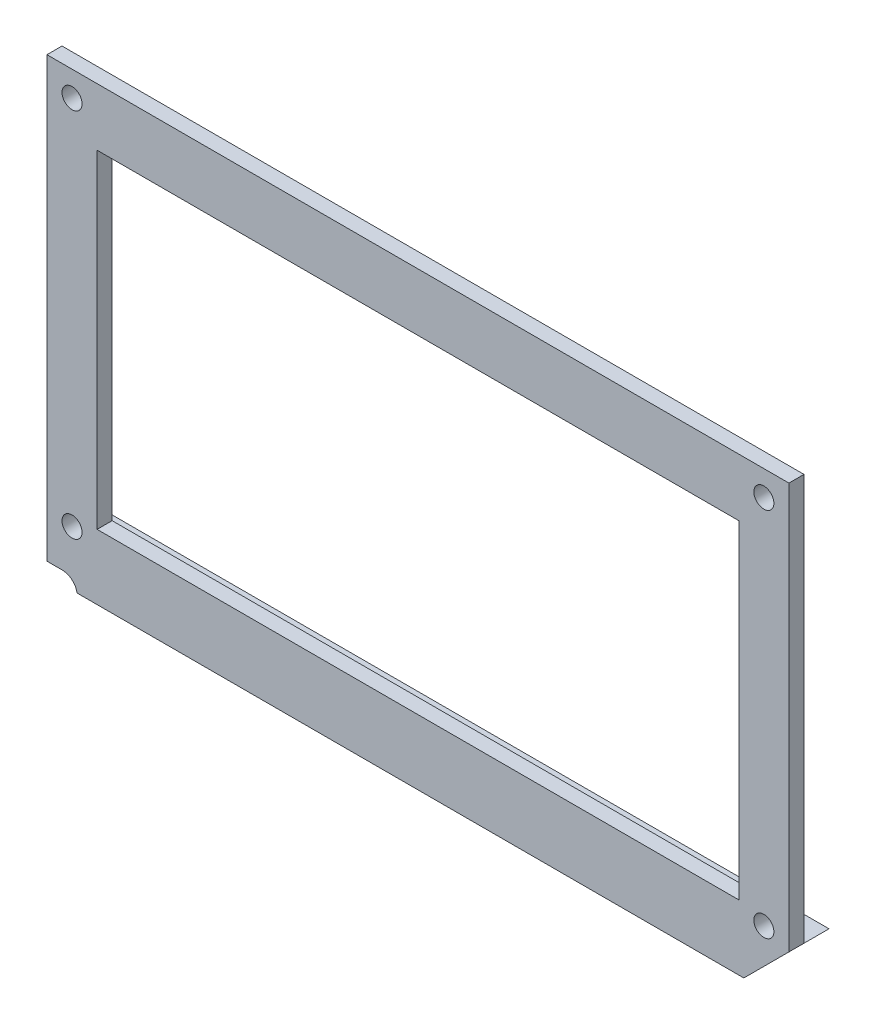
ISO-10303-21;
HEADER;
FILE_DESCRIPTION(('STEP AP214'),'2;1');
FILE_NAME('part.step','',(''),(''),'','','');
FILE_SCHEMA(('AUTOMOTIVE_DESIGN { 1 0 10303 214 1 1 1 1 }'));
ENDSEC;
DATA;
#1=APPLICATION_CONTEXT('core data for automotive mechanical design processes');
#2=APPLICATION_PROTOCOL_DEFINITION('international standard','automotive_design',2000,#1);
#3=PRODUCT_CONTEXT('',#1,'mechanical');
#4=PRODUCT('Part','Part','',(#3));
#5=PRODUCT_RELATED_PRODUCT_CATEGORY('part','',(#4));
#6=PRODUCT_DEFINITION_FORMATION('','',#4);
#7=PRODUCT_DEFINITION_CONTEXT('part definition',#1,'design');
#8=PRODUCT_DEFINITION('design','',#6,#7);
#9=PRODUCT_DEFINITION_SHAPE('','',#8);
#10=(LENGTH_UNIT() NAMED_UNIT(*) SI_UNIT(.MILLI.,.METRE.));
#11=(NAMED_UNIT(*) PLANE_ANGLE_UNIT() SI_UNIT($,.RADIAN.));
#12=(NAMED_UNIT(*) SI_UNIT($,.STERADIAN.) SOLID_ANGLE_UNIT());
#13=UNCERTAINTY_MEASURE_WITH_UNIT(LENGTH_MEASURE(1.E-05),#10,'distance_accuracy_value','');
#14=(GEOMETRIC_REPRESENTATION_CONTEXT(3) GLOBAL_UNCERTAINTY_ASSIGNED_CONTEXT((#13)) GLOBAL_UNIT_ASSIGNED_CONTEXT((#10,
#11,#12)) REPRESENTATION_CONTEXT('',''));
#15=CARTESIAN_POINT('',(0.,0.,0.));
#16=DIRECTION('',(0.,0.,1.));
#17=DIRECTION('',(1.,0.,0.));
#18=AXIS2_PLACEMENT_3D('',#15,#16,#17);
#19=CARTESIAN_POINT('',(40.,-31.5000000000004,-0.250000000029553));
#20=DIRECTION('',(-1.,0.,0.));
#21=DIRECTION('',(0.,1.,7.78409621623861E-13));
#22=AXIS2_PLACEMENT_3D('',#19,#20,#21);
#23=CYLINDRICAL_SURFACE('',#22,3.);
#24=CARTESIAN_POINT('',(-40.,-31.5000000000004,-0.250000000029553));
#25=DIRECTION('',(-0.707106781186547,-5.50418721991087E-13,0.707106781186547));
#26=DIRECTION('',(0.707106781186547,-5.50418721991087E-13,0.707106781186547));
#27=AXIS2_PLACEMENT_3D('',#24,#25,#26);
#28=ELLIPSE('',#27,4.24264068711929,3.);
#29=CARTESIAN_POINT('',(-40.,-34.5000000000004,-0.250000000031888));
#30=VERTEX_POINT('',#29);
#31=CARTESIAN_POINT('',(-37.,-31.5000000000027,2.74999999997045));
#32=VERTEX_POINT('',#31);
#33=EDGE_CURVE('E159',#30,#32,#28,.T.);
#34=ORIENTED_EDGE('',*,*,#33,.T.);
#35=DIRECTION('',(-1.,0.,0.));
#36=VECTOR('',#35,1.);
#37=CARTESIAN_POINT('',(40.,-31.5000000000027,2.74999999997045));
#38=LINE('',#37,#36);
#39=CARTESIAN_POINT('',(37.,-31.5000000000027,2.74999999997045));
#40=VERTEX_POINT('',#39);
#41=EDGE_CURVE('E171',#40,#32,#38,.T.);
#42=ORIENTED_EDGE('',*,*,#41,.F.);
#43=CARTESIAN_POINT('',(40.,-31.5000000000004,-0.250000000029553));
#44=DIRECTION('',(0.707106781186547,-5.50418721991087E-13,0.707106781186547));
#45=DIRECTION('',(-0.707106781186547,-5.50418721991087E-13,0.707106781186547));
#46=AXIS2_PLACEMENT_3D('',#43,#44,#45);
#47=ELLIPSE('',#46,4.24264068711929,3.);
#48=CARTESIAN_POINT('',(40.,-34.5000000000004,-0.250000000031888));
#49=VERTEX_POINT('',#48);
#50=EDGE_CURVE('E451',#40,#49,#47,.T.);
#51=ORIENTED_EDGE('',*,*,#50,.T.);
#52=DIRECTION('',(-1.,0.,0.));
#53=VECTOR('',#52,1.);
#54=CARTESIAN_POINT('',(40.,-34.5000000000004,-0.250000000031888));
#55=LINE('',#54,#53);
#56=EDGE_CURVE('E173',#49,#30,#55,.T.);
#57=ORIENTED_EDGE('',*,*,#56,.T.);
#58=EDGE_LOOP('',(#34,#42,#51,#57));
#59=FACE_BOUND('',#58,.T.);
#60=ADVANCED_FACE('F44',(#59),#23,.F.);
#61=CARTESIAN_POINT('',(0.,7.24999999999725,2.75000000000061));
#62=DIRECTION('',(0.,7.78409621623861E-13,-1.));
#63=DIRECTION('',(0.,1.,7.78409621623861E-13));
#64=AXIS2_PLACEMENT_3D('',#61,#62,#63);
#65=PLANE('',#64);
#66=DIRECTION('',(0.,-1.,-7.78409621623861E-13));
#67=VECTOR('',#66,1.);
#68=CARTESIAN_POINT('',(74.,-38.5000000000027,2.749999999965));
#69=LINE('',#68,#67);
#70=CARTESIAN_POINT('',(74.,51.4999999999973,2.75000000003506));
#71=VERTEX_POINT('',#70);
#72=CARTESIAN_POINT('',(74.,-29.5000000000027,2.749999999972));
#73=VERTEX_POINT('',#72);
#74=EDGE_CURVE('E314',#71,#73,#69,.T.);
#75=ORIENTED_EDGE('',*,*,#74,.T.);
#76=DIRECTION('',(0.707106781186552,0.707106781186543,5.50418721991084E-13));
#77=VECTOR('',#76,1.);
#78=CARTESIAN_POINT('',(55.3749999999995,-48.1250000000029,2.74999999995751));
#79=LINE('',#78,#77);
#80=CARTESIAN_POINT('',(68.9999999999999,-34.5000000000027,2.74999999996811));
#81=VERTEX_POINT('',#80);
#82=EDGE_CURVE('E354',#73,#81,#79,.F.);
#83=ORIENTED_EDGE('',*,*,#82,.T.);
#84=DIRECTION('',(1.,0.,0.));
#85=VECTOR('',#84,1.);
#86=CARTESIAN_POINT('',(-74.,-34.5000000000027,2.74999999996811));
#87=LINE('',#86,#85);
#88=CARTESIAN_POINT('',(40.,-34.5000000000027,2.74999999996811));
#89=VERTEX_POINT('',#88);
#90=EDGE_CURVE('E214',#89,#81,#87,.T.);
#91=ORIENTED_EDGE('',*,*,#90,.F.);
#92=CARTESIAN_POINT('',(40.,-31.5000000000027,2.74999999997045));
#93=DIRECTION('',(0.,7.78409621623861E-13,-1.));
#94=DIRECTION('',(0.,1.,7.78409621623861E-13));
#95=AXIS2_PLACEMENT_3D('',#92,#93,#94);
#96=CIRCLE('',#95,3.);
#97=EDGE_CURVE('E175',#89,#40,#96,.T.);
#98=ORIENTED_EDGE('',*,*,#97,.T.);
#99=ORIENTED_EDGE('',*,*,#41,.T.);
#100=CARTESIAN_POINT('',(-40.,-31.5000000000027,2.74999999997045));
#101=DIRECTION('',(0.,7.78409621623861E-13,-1.));
#102=DIRECTION('',(0.,1.,7.78409621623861E-13));
#103=AXIS2_PLACEMENT_3D('',#100,#101,#102);
#104=CIRCLE('',#103,3.);
#105=CARTESIAN_POINT('',(-40.,-34.5000000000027,2.74999999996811));
#106=VERTEX_POINT('',#105);
#107=EDGE_CURVE('E156',#32,#106,#104,.T.);
#108=ORIENTED_EDGE('',*,*,#107,.T.);
#109=CARTESIAN_POINT('',(-74.,-34.5000000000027,2.74999999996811));
#110=VERTEX_POINT('',#109);
#111=EDGE_CURVE('E225',#110,#106,#87,.T.);
#112=ORIENTED_EDGE('',*,*,#111,.F.);
#113=DIRECTION('',(0.,1.,7.78409621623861E-13));
#114=VECTOR('',#113,1.);
#115=CARTESIAN_POINT('',(-74.,-38.5000000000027,2.749999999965));
#116=LINE('',#115,#114);
#117=CARTESIAN_POINT('',(-74.,51.4999999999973,2.75000000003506));
#118=VERTEX_POINT('',#117);
#119=EDGE_CURVE('E317',#110,#118,#116,.T.);
#120=ORIENTED_EDGE('',*,*,#119,.T.);
#121=DIRECTION('',(1.,0.,0.));
#122=VECTOR('',#121,1.);
#123=CARTESIAN_POINT('',(-74.,51.4999999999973,2.75000000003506));
#124=LINE('',#123,#122);
#125=EDGE_CURVE('E321',#118,#71,#124,.T.);
#126=ORIENTED_EDGE('',*,*,#125,.T.);
#127=EDGE_LOOP('',(#75,#83,#91,#98,#99,#108,#112,#120,#126));
#128=FACE_BOUND('',#127,.T.);
#129=CARTESIAN_POINT('',(-69.,-27.5000000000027,2.74999999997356));
#130=DIRECTION('',(0.,7.78409621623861E-13,-1.));
#131=DIRECTION('',(0.,1.,7.78409621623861E-13));
#132=AXIS2_PLACEMENT_3D('',#129,#130,#131);
#133=CIRCLE('',#132,2.);
#134=CARTESIAN_POINT('',(-69.,-25.5000000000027,2.74999999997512));
#135=VERTEX_POINT('',#134);
#136=EDGE_CURVE('E247',#135,#135,#133,.T.);
#137=ORIENTED_EDGE('',*,*,#136,.F.);
#138=EDGE_LOOP('',(#137));
#139=FACE_BOUND('',#138,.T.);
#140=CARTESIAN_POINT('',(69.,-27.5000000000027,2.74999999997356));
#141=DIRECTION('',(0.,7.78409621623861E-13,-1.));
#142=DIRECTION('',(0.,1.,7.78409621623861E-13));
#143=AXIS2_PLACEMENT_3D('',#140,#141,#142);
#144=CIRCLE('',#143,2.);
#145=CARTESIAN_POINT('',(69.,-25.5000000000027,2.74999999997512));
#146=VERTEX_POINT('',#145);
#147=EDGE_CURVE('E263',#146,#146,#144,.T.);
#148=ORIENTED_EDGE('',*,*,#147,.F.);
#149=EDGE_LOOP('',(#148));
#150=FACE_BOUND('',#149,.T.);
#151=DIRECTION('',(-1.,0.,0.));
#152=VECTOR('',#151,1.);
#153=CARTESIAN_POINT('',(-64.,-25.5000000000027,2.74999999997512));
#154=LINE('',#153,#152);
#155=CARTESIAN_POINT('',(64.,-25.5000000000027,2.74999999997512));
#156=VERTEX_POINT('',#155);
#157=CARTESIAN_POINT('',(-64.,-25.5000000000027,2.74999999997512));
#158=VERTEX_POINT('',#157);
#159=EDGE_CURVE('E274',#156,#158,#154,.T.);
#160=ORIENTED_EDGE('',*,*,#159,.F.);
#161=DIRECTION('',(0.,-1.,-7.78409621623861E-13));
#162=VECTOR('',#161,1.);
#163=CARTESIAN_POINT('',(64.,-25.5000000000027,2.74999999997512));
#164=LINE('',#163,#162);
#165=CARTESIAN_POINT('',(64.,39.9999999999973,2.7500000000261));
#166=VERTEX_POINT('',#165);
#167=EDGE_CURVE('E271',#166,#156,#164,.T.);
#168=ORIENTED_EDGE('',*,*,#167,.F.);
#169=DIRECTION('',(1.,0.,0.));
#170=VECTOR('',#169,1.);
#171=CARTESIAN_POINT('',(-64.,39.9999999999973,2.7500000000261));
#172=LINE('',#171,#170);
#173=CARTESIAN_POINT('',(-64.,39.9999999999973,2.7500000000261));
#174=VERTEX_POINT('',#173);
#175=EDGE_CURVE('E282',#174,#166,#172,.T.);
#176=ORIENTED_EDGE('',*,*,#175,.F.);
#177=DIRECTION('',(0.,1.,7.78409621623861E-13));
#178=VECTOR('',#177,1.);
#179=CARTESIAN_POINT('',(-64.,-25.5000000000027,2.74999999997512));
#180=LINE('',#179,#178);
#181=EDGE_CURVE('E278',#158,#174,#180,.T.);
#182=ORIENTED_EDGE('',*,*,#181,.F.);
#183=EDGE_LOOP('',(#160,#168,#176,#182));
#184=FACE_BOUND('',#183,.T.);
#185=CARTESIAN_POINT('',(69.,46.4999999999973,2.75000000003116));
#186=DIRECTION('',(0.,7.78409621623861E-13,-1.));
#187=DIRECTION('',(0.,1.,7.78409621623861E-13));
#188=AXIS2_PLACEMENT_3D('',#185,#186,#187);
#189=CIRCLE('',#188,2.);
#190=CARTESIAN_POINT('',(69.,48.4999999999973,2.75000000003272));
#191=VERTEX_POINT('',#190);
#192=EDGE_CURVE('E255',#191,#191,#189,.T.);
#193=ORIENTED_EDGE('',*,*,#192,.F.);
#194=EDGE_LOOP('',(#193));
#195=FACE_BOUND('',#194,.T.);
#196=CARTESIAN_POINT('',(-69.,46.4999999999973,2.75000000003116));
#197=DIRECTION('',(0.,7.78409621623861E-13,-1.));
#198=DIRECTION('',(0.,1.,7.78409621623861E-13));
#199=AXIS2_PLACEMENT_3D('',#196,#197,#198);
#200=CIRCLE('',#199,2.);
#201=CARTESIAN_POINT('',(-69.,48.4999999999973,2.75000000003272));
#202=VERTEX_POINT('',#201);
#203=EDGE_CURVE('E239',#202,#202,#200,.T.);
#204=ORIENTED_EDGE('',*,*,#203,.F.);
#205=EDGE_LOOP('',(#204));
#206=FACE_BOUND('',#205,.T.);
#207=ADVANCED_FACE('F179',(#128,#139,#150,#184,#195,#206),#65,.T.);
#208=CARTESIAN_POINT('',(-74.,-34.4999999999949,-7.25000000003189));
#209=DIRECTION('',(0.,-1.,-7.78409621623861E-13));
#210=DIRECTION('',(-1.,0.,0.));
#211=AXIS2_PLACEMENT_3D('',#208,#209,#210);
#212=PLANE('',#211);
#213=CARTESIAN_POINT('',(57.,-34.4999999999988,-2.25000000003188));
#214=DIRECTION('',(0.,-1.,-7.78409621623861E-13));
#215=DIRECTION('',(-1.,0.,0.));
#216=AXIS2_PLACEMENT_3D('',#213,#214,#215);
#217=CIRCLE('',#216,2.15);
#218=CARTESIAN_POINT('',(54.85,-34.4999999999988,-2.25000000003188));
#219=VERTEX_POINT('',#218);
#220=EDGE_CURVE('E210',#219,#219,#217,.F.);
#221=ORIENTED_EDGE('',*,*,#220,.F.);
#222=EDGE_LOOP('',(#221));
#223=FACE_BOUND('',#222,.T.);
#224=CARTESIAN_POINT('',(-48.,-34.4999999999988,-2.25000000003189));
#225=DIRECTION('',(0.,-1.,-7.78409621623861E-13));
#226=DIRECTION('',(-1.,0.,0.));
#227=AXIS2_PLACEMENT_3D('',#224,#225,#226);
#228=CIRCLE('',#227,2.15);
#229=CARTESIAN_POINT('',(-50.15,-34.4999999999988,-2.25000000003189));
#230=VERTEX_POINT('',#229);
#231=EDGE_CURVE('E209',#230,#230,#228,.F.);
#232=ORIENTED_EDGE('',*,*,#231,.F.);
#233=EDGE_LOOP('',(#232));
#234=FACE_BOUND('',#233,.T.);
#235=ORIENTED_EDGE('',*,*,#90,.T.);
#236=DIRECTION('',(0.,-7.78409621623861E-13,1.));
#237=VECTOR('',#236,1.);
#238=CARTESIAN_POINT('',(68.9999999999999,-34.5000000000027,2.74999999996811));
#239=LINE('',#238,#237);
#240=CARTESIAN_POINT('',(68.9999999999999,-34.4999999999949,-7.25000000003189));
#241=VERTEX_POINT('',#240);
#242=EDGE_CURVE('E357',#81,#241,#239,.F.);
#243=ORIENTED_EDGE('',*,*,#242,.T.);
#244=DIRECTION('',(1.,0.,0.));
#245=VECTOR('',#244,1.);
#246=CARTESIAN_POINT('',(-74.,-34.4999999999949,-7.25000000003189));
#247=LINE('',#246,#245);
#248=CARTESIAN_POINT('',(-74.,-34.4999999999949,-7.25000000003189));
#249=VERTEX_POINT('',#248);
#250=EDGE_CURVE('E224',#249,#241,#247,.T.);
#251=ORIENTED_EDGE('',*,*,#250,.F.);
#252=DIRECTION('',(0.,-7.78409621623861E-13,1.));
#253=VECTOR('',#252,1.);
#254=CARTESIAN_POINT('',(-74.,-34.4999999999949,-7.25000000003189));
#255=LINE('',#254,#253);
#256=EDGE_CURVE('E232',#249,#110,#255,.T.);
#257=ORIENTED_EDGE('',*,*,#256,.T.);
#258=ORIENTED_EDGE('',*,*,#111,.T.);
#259=DIRECTION('',(0.,7.78409621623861E-13,-1.));
#260=VECTOR('',#259,1.);
#261=CARTESIAN_POINT('',(-40.,-34.5000000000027,2.74999999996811));
#262=LINE('',#261,#260);
#263=EDGE_CURVE('E162',#106,#30,#262,.T.);
#264=ORIENTED_EDGE('',*,*,#263,.T.);
#265=ORIENTED_EDGE('',*,*,#56,.F.);
#266=DIRECTION('',(0.,7.78409621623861E-13,-1.));
#267=VECTOR('',#266,1.);
#268=CARTESIAN_POINT('',(40.,-34.5000000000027,2.74999999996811));
#269=LINE('',#268,#267);
#270=EDGE_CURVE('E183',#89,#49,#269,.T.);
#271=ORIENTED_EDGE('',*,*,#270,.F.);
#272=EDGE_LOOP('',(#235,#243,#251,#257,#258,#264,#265,#271));
#273=FACE_BOUND('',#272,.T.);
#274=ADVANCED_FACE('F391',(#223,#234,#273),#212,.F.);
#275=CARTESIAN_POINT('',(-74.,-38.5000000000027,2.749999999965));
#276=DIRECTION('',(1.,0.,0.));
#277=DIRECTION('',(0.,-1.,-7.78409621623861E-13));
#278=AXIS2_PLACEMENT_3D('',#275,#276,#277);
#279=PLANE('',#278);
#280=DIRECTION('',(0.,7.78409621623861E-13,-1.));
#281=VECTOR('',#280,1.);
#282=CARTESIAN_POINT('',(-74.,-36.0000000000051,5.74999999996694));
#283=LINE('',#282,#281);
#284=CARTESIAN_POINT('',(-74.,-36.0000000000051,5.74999999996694));
#285=VERTEX_POINT('',#284);
#286=CARTESIAN_POINT('',(-74.,-35.999999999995,-7.25000000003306));
#287=VERTEX_POINT('',#286);
#288=EDGE_CURVE('E193',#285,#287,#283,.T.);
#289=ORIENTED_EDGE('',*,*,#288,.F.);
#290=DIRECTION('',(0.,1.,7.78409621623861E-13));
#291=VECTOR('',#290,1.);
#292=CARTESIAN_POINT('',(-74.,-38.5000000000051,5.749999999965));
#293=LINE('',#292,#291);
#294=CARTESIAN_POINT('',(-74.,51.4999999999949,5.75000000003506));
#295=VERTEX_POINT('',#294);
#296=EDGE_CURVE('E332',#285,#295,#293,.T.);
#297=ORIENTED_EDGE('',*,*,#296,.T.);
#298=DIRECTION('',(0.,-7.78409621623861E-13,1.));
#299=VECTOR('',#298,1.);
#300=CARTESIAN_POINT('',(-74.,51.4999999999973,2.75000000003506));
#301=LINE('',#300,#299);
#302=EDGE_CURVE('E340',#118,#295,#301,.T.);
#303=ORIENTED_EDGE('',*,*,#302,.F.);
#304=ORIENTED_EDGE('',*,*,#119,.F.);
#305=ORIENTED_EDGE('',*,*,#256,.F.);
#306=DIRECTION('',(0.,1.,7.78409621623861E-13));
#307=VECTOR('',#306,1.);
#308=CARTESIAN_POINT('',(-74.,-38.499999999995,-7.250000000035));
#309=LINE('',#308,#307);
#310=EDGE_CURVE('E221',#287,#249,#309,.T.);
#311=ORIENTED_EDGE('',*,*,#310,.F.);
#312=EDGE_LOOP('',(#289,#297,#303,#304,#305,#311));
#313=FACE_BOUND('',#312,.T.);
#314=ADVANCED_FACE('F386',(#313),#279,.F.);
#315=CARTESIAN_POINT('',(0.,7.24999999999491,5.75000000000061));
#316=DIRECTION('',(0.,7.78409621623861E-13,-1.));
#317=DIRECTION('',(0.,1.,7.78409621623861E-13));
#318=AXIS2_PLACEMENT_3D('',#315,#316,#317);
#319=PLANE('',#318);
#320=DIRECTION('',(-1.,0.,0.));
#321=VECTOR('',#320,1.);
#322=CARTESIAN_POINT('',(-74.,-38.5000000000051,5.749999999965));
#323=LINE('',#322,#321);
#324=CARTESIAN_POINT('',(64.9999999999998,-38.5000000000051,5.749999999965));
#325=VERTEX_POINT('',#324);
#326=CARTESIAN_POINT('',(-68.,-38.5000000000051,5.749999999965));
#327=VERTEX_POINT('',#326);
#328=EDGE_CURVE('E328',#325,#327,#323,.T.);
#329=ORIENTED_EDGE('',*,*,#328,.F.);
#330=DIRECTION('',(-0.707106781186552,-0.707106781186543,-5.50418721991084E-13));
#331=VECTOR('',#330,1.);
#332=CARTESIAN_POINT('',(64.9999999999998,-38.5000000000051,5.749999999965));
#333=LINE('',#332,#331);
#334=CARTESIAN_POINT('',(74.,-29.500000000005,5.749999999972));
#335=VERTEX_POINT('',#334);
#336=EDGE_CURVE('E348',#325,#335,#333,.F.);
#337=ORIENTED_EDGE('',*,*,#336,.T.);
#338=DIRECTION('',(0.,-1.,-7.78409621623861E-13));
#339=VECTOR('',#338,1.);
#340=CARTESIAN_POINT('',(74.,-38.5000000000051,5.749999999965));
#341=LINE('',#340,#339);
#342=CARTESIAN_POINT('',(74.,51.4999999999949,5.75000000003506));
#343=VERTEX_POINT('',#342);
#344=EDGE_CURVE('E313',#343,#335,#341,.T.);
#345=ORIENTED_EDGE('',*,*,#344,.F.);
#346=DIRECTION('',(1.,0.,0.));
#347=VECTOR('',#346,1.);
#348=CARTESIAN_POINT('',(-74.,51.4999999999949,5.75000000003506));
#349=LINE('',#348,#347);
#350=EDGE_CURVE('E318',#295,#343,#349,.T.);
#351=ORIENTED_EDGE('',*,*,#350,.F.);
#352=ORIENTED_EDGE('',*,*,#296,.F.);
#353=DIRECTION('',(-1.,0.,0.));
#354=VECTOR('',#353,1.);
#355=CARTESIAN_POINT('',(-74.,-36.0000000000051,5.74999999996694));
#356=LINE('',#355,#354);
#357=CARTESIAN_POINT('',(-70.9580398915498,-36.0000000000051,5.74999999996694));
#358=VERTEX_POINT('',#357);
#359=EDGE_CURVE('E199',#358,#285,#356,.T.);
#360=ORIENTED_EDGE('',*,*,#359,.F.);
#361=CARTESIAN_POINT('',(-70.9580398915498,-39.0000000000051,5.74999999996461));
#362=DIRECTION('',(0.,7.78409621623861E-13,-1.));
#363=DIRECTION('',(0.,1.,7.78409621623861E-13));
#364=AXIS2_PLACEMENT_3D('',#361,#362,#363);
#365=CIRCLE('',#364,3.);
#366=EDGE_CURVE('E53',#358,#327,#365,.T.);
#367=ORIENTED_EDGE('',*,*,#366,.T.);
#368=EDGE_LOOP('',(#329,#337,#345,#351,#352,#360,#367));
#369=FACE_BOUND('',#368,.T.);
#370=DIRECTION('',(0.,-1.,-7.78409621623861E-13));
#371=VECTOR('',#370,1.);
#372=CARTESIAN_POINT('',(64.,-25.5000000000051,5.74999999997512));
#373=LINE('',#372,#371);
#374=CARTESIAN_POINT('',(64.,39.9999999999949,5.7500000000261));
#375=VERTEX_POINT('',#374);
#376=CARTESIAN_POINT('',(64.,-25.5000000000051,5.74999999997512));
#377=VERTEX_POINT('',#376);
#378=EDGE_CURVE('E267',#375,#377,#373,.T.);
#379=ORIENTED_EDGE('',*,*,#378,.T.);
#380=DIRECTION('',(-1.,0.,0.));
#381=VECTOR('',#380,1.);
#382=CARTESIAN_POINT('',(-64.,-25.5000000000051,5.74999999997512));
#383=LINE('',#382,#381);
#384=CARTESIAN_POINT('',(-64.,-25.5000000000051,5.74999999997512));
#385=VERTEX_POINT('',#384);
#386=EDGE_CURVE('E289',#377,#385,#383,.T.);
#387=ORIENTED_EDGE('',*,*,#386,.T.);
#388=DIRECTION('',(0.,1.,7.78409621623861E-13));
#389=VECTOR('',#388,1.);
#390=CARTESIAN_POINT('',(-64.,-25.5000000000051,5.74999999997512));
#391=LINE('',#390,#389);
#392=CARTESIAN_POINT('',(-64.,39.9999999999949,5.7500000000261));
#393=VERTEX_POINT('',#392);
#394=EDGE_CURVE('E293',#385,#393,#391,.T.);
#395=ORIENTED_EDGE('',*,*,#394,.T.);
#396=DIRECTION('',(1.,0.,0.));
#397=VECTOR('',#396,1.);
#398=CARTESIAN_POINT('',(-64.,39.9999999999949,5.7500000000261));
#399=LINE('',#398,#397);
#400=EDGE_CURVE('E275',#393,#375,#399,.T.);
#401=ORIENTED_EDGE('',*,*,#400,.T.);
#402=EDGE_LOOP('',(#379,#387,#395,#401));
#403=FACE_BOUND('',#402,.T.);
#404=CARTESIAN_POINT('',(69.,-27.5000000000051,5.74999999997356));
#405=DIRECTION('',(0.,7.78409621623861E-13,-1.));
#406=DIRECTION('',(0.,1.,7.78409621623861E-13));
#407=AXIS2_PLACEMENT_3D('',#404,#405,#406);
#408=CIRCLE('',#407,2.);
#409=CARTESIAN_POINT('',(69.,-25.5000000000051,5.74999999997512));
#410=VERTEX_POINT('',#409);
#411=EDGE_CURVE('E259',#410,#410,#408,.T.);
#412=ORIENTED_EDGE('',*,*,#411,.T.);
#413=EDGE_LOOP('',(#412));
#414=FACE_BOUND('',#413,.T.);
#415=CARTESIAN_POINT('',(69.,46.4999999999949,5.75000000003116));
#416=DIRECTION('',(0.,7.78409621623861E-13,-1.));
#417=DIRECTION('',(0.,1.,7.78409621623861E-13));
#418=AXIS2_PLACEMENT_3D('',#415,#416,#417);
#419=CIRCLE('',#418,2.);
#420=CARTESIAN_POINT('',(69.,48.4999999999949,5.75000000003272));
#421=VERTEX_POINT('',#420);
#422=EDGE_CURVE('E251',#421,#421,#419,.T.);
#423=ORIENTED_EDGE('',*,*,#422,.T.);
#424=EDGE_LOOP('',(#423));
#425=FACE_BOUND('',#424,.T.);
#426=CARTESIAN_POINT('',(-69.,-27.5000000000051,5.74999999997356));
#427=DIRECTION('',(0.,7.78409621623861E-13,-1.));
#428=DIRECTION('',(0.,1.,7.78409621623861E-13));
#429=AXIS2_PLACEMENT_3D('',#426,#427,#428);
#430=CIRCLE('',#429,2.);
#431=CARTESIAN_POINT('',(-69.,-25.5000000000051,5.74999999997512));
#432=VERTEX_POINT('',#431);
#433=EDGE_CURVE('E243',#432,#432,#430,.T.);
#434=ORIENTED_EDGE('',*,*,#433,.T.);
#435=EDGE_LOOP('',(#434));
#436=FACE_BOUND('',#435,.T.);
#437=CARTESIAN_POINT('',(-69.,46.4999999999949,5.75000000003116));
#438=DIRECTION('',(0.,7.78409621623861E-13,-1.));
#439=DIRECTION('',(0.,1.,7.78409621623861E-13));
#440=AXIS2_PLACEMENT_3D('',#437,#438,#439);
#441=CIRCLE('',#440,2.);
#442=CARTESIAN_POINT('',(-69.,48.4999999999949,5.75000000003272));
#443=VERTEX_POINT('',#442);
#444=EDGE_CURVE('E238',#443,#443,#441,.T.);
#445=ORIENTED_EDGE('',*,*,#444,.T.);
#446=EDGE_LOOP('',(#445));
#447=FACE_BOUND('',#446,.T.);
#448=ADVANCED_FACE('F370',(#369,#403,#414,#425,#436,#447),#319,.F.);
#449=CARTESIAN_POINT('',(74.,-38.5000000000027,2.749999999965));
#450=DIRECTION('',(-1.,0.,0.));
#451=DIRECTION('',(0.,1.,7.78409621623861E-13));
#452=AXIS2_PLACEMENT_3D('',#449,#450,#451);
#453=PLANE('',#452);
#454=ORIENTED_EDGE('',*,*,#344,.T.);
#455=DIRECTION('',(0.,7.78409621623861E-13,-1.));
#456=VECTOR('',#455,1.);
#457=CARTESIAN_POINT('',(74.,-29.5000000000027,2.749999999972));
#458=LINE('',#457,#456);
#459=EDGE_CURVE('E351',#335,#73,#458,.T.);
#460=ORIENTED_EDGE('',*,*,#459,.T.);
#461=ORIENTED_EDGE('',*,*,#74,.F.);
#462=DIRECTION('',(0.,-7.78409621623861E-13,1.));
#463=VECTOR('',#462,1.);
#464=CARTESIAN_POINT('',(74.,51.4999999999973,2.75000000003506));
#465=LINE('',#464,#463);
#466=EDGE_CURVE('E324',#71,#343,#465,.T.);
#467=ORIENTED_EDGE('',*,*,#466,.T.);
#468=EDGE_LOOP('',(#454,#460,#461,#467));
#469=FACE_BOUND('',#468,.T.);
#470=ADVANCED_FACE('F401',(#469),#453,.F.);
#471=CARTESIAN_POINT('',(-74.,-38.5000000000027,2.749999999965));
#472=DIRECTION('',(0.,1.,7.78409621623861E-13));
#473=DIRECTION('',(1.,0.,0.));
#474=AXIS2_PLACEMENT_3D('',#471,#472,#473);
#475=PLANE('',#474);
#476=CARTESIAN_POINT('',(-48.,-38.4999999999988,-2.250000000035));
#477=DIRECTION('',(0.,-1.,-7.78409621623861E-13));
#478=DIRECTION('',(-1.,0.,0.));
#479=AXIS2_PLACEMENT_3D('',#476,#477,#478);
#480=CIRCLE('',#479,2.15);
#481=CARTESIAN_POINT('',(-50.15,-38.4999999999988,-2.250000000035));
#482=VERTEX_POINT('',#481);
#483=EDGE_CURVE('E205',#482,#482,#480,.T.);
#484=ORIENTED_EDGE('',*,*,#483,.F.);
#485=EDGE_LOOP('',(#484));
#486=FACE_BOUND('',#485,.T.);
#487=CARTESIAN_POINT('',(57.,-38.4999999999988,-2.25000000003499));
#488=DIRECTION('',(0.,-1.,-7.78409621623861E-13));
#489=DIRECTION('',(-1.,0.,0.));
#490=AXIS2_PLACEMENT_3D('',#487,#488,#489);
#491=CIRCLE('',#490,2.15);
#492=CARTESIAN_POINT('',(54.85,-38.4999999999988,-2.25000000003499));
#493=VERTEX_POINT('',#492);
#494=EDGE_CURVE('E202',#493,#493,#491,.T.);
#495=ORIENTED_EDGE('',*,*,#494,.F.);
#496=EDGE_LOOP('',(#495));
#497=FACE_BOUND('',#496,.T.);
#498=DIRECTION('',(-1.,0.,0.));
#499=VECTOR('',#498,1.);
#500=CARTESIAN_POINT('',(-74.,-38.499999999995,-7.250000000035));
#501=LINE('',#500,#499);
#502=CARTESIAN_POINT('',(64.9999999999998,-38.499999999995,-7.250000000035));
#503=VERTEX_POINT('',#502);
#504=CARTESIAN_POINT('',(-68.,-38.499999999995,-7.250000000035));
#505=VERTEX_POINT('',#504);
#506=EDGE_CURVE('E229',#503,#505,#501,.T.);
#507=ORIENTED_EDGE('',*,*,#506,.F.);
#508=DIRECTION('',(0.,-7.78409621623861E-13,1.));
#509=VECTOR('',#508,1.);
#510=CARTESIAN_POINT('',(64.9999999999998,-38.5000000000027,2.749999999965));
#511=LINE('',#510,#509);
#512=EDGE_CURVE('E344',#503,#325,#511,.T.);
#513=ORIENTED_EDGE('',*,*,#512,.T.);
#514=ORIENTED_EDGE('',*,*,#328,.T.);
#515=DIRECTION('',(0.,-7.78409621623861E-13,1.));
#516=VECTOR('',#515,1.);
#517=CARTESIAN_POINT('',(-68.,-38.5000000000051,5.749999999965));
#518=LINE('',#517,#516);
#519=EDGE_CURVE('E188',#505,#327,#518,.T.);
#520=ORIENTED_EDGE('',*,*,#519,.F.);
#521=EDGE_LOOP('',(#507,#513,#514,#520));
#522=FACE_BOUND('',#521,.T.);
#523=ADVANCED_FACE('F376',(#486,#497,#522),#475,.F.);
#524=CARTESIAN_POINT('',(-74.,51.4999999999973,2.75000000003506));
#525=DIRECTION('',(0.,-1.,-7.78409621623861E-13));
#526=DIRECTION('',(-1.,0.,0.));
#527=AXIS2_PLACEMENT_3D('',#524,#525,#526);
#528=PLANE('',#527);
#529=ORIENTED_EDGE('',*,*,#350,.T.);
#530=ORIENTED_EDGE('',*,*,#466,.F.);
#531=ORIENTED_EDGE('',*,*,#125,.F.);
#532=ORIENTED_EDGE('',*,*,#302,.T.);
#533=EDGE_LOOP('',(#529,#530,#531,#532));
#534=FACE_BOUND('',#533,.T.);
#535=ADVANCED_FACE('F406',(#534),#528,.F.);
#536=CARTESIAN_POINT('',(64.,-25.5000000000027,2.74999999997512));
#537=DIRECTION('',(-1.,0.,0.));
#538=DIRECTION('',(0.,1.,7.78409621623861E-13));
#539=AXIS2_PLACEMENT_3D('',#536,#537,#538);
#540=PLANE('',#539);
#541=ORIENTED_EDGE('',*,*,#378,.F.);
#542=DIRECTION('',(0.,-7.78409621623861E-13,1.));
#543=VECTOR('',#542,1.);
#544=CARTESIAN_POINT('',(64.,39.9999999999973,2.7500000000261));
#545=LINE('',#544,#543);
#546=EDGE_CURVE('E285',#166,#375,#545,.T.);
#547=ORIENTED_EDGE('',*,*,#546,.F.);
#548=ORIENTED_EDGE('',*,*,#167,.T.);
#549=DIRECTION('',(0.,-7.78409621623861E-13,1.));
#550=VECTOR('',#549,1.);
#551=CARTESIAN_POINT('',(64.,-25.5000000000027,2.74999999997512));
#552=LINE('',#551,#550);
#553=EDGE_CURVE('E309',#156,#377,#552,.T.);
#554=ORIENTED_EDGE('',*,*,#553,.T.);
#555=EDGE_LOOP('',(#541,#547,#548,#554));
#556=FACE_BOUND('',#555,.T.);
#557=ADVANCED_FACE('F531',(#556),#540,.T.);
#558=CARTESIAN_POINT('',(-64.,-25.5000000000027,2.74999999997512));
#559=DIRECTION('',(0.,1.,7.78409621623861E-13));
#560=DIRECTION('',(1.,0.,0.));
#561=AXIS2_PLACEMENT_3D('',#558,#559,#560);
#562=PLANE('',#561);
#563=ORIENTED_EDGE('',*,*,#386,.F.);
#564=ORIENTED_EDGE('',*,*,#553,.F.);
#565=ORIENTED_EDGE('',*,*,#159,.T.);
#566=DIRECTION('',(0.,-7.78409621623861E-13,1.));
#567=VECTOR('',#566,1.);
#568=CARTESIAN_POINT('',(-64.,-25.5000000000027,2.74999999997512));
#569=LINE('',#568,#567);
#570=EDGE_CURVE('E306',#158,#385,#569,.T.);
#571=ORIENTED_EDGE('',*,*,#570,.T.);
#572=EDGE_LOOP('',(#563,#564,#565,#571));
#573=FACE_BOUND('',#572,.T.);
#574=ADVANCED_FACE('F527',(#573),#562,.T.);
#575=CARTESIAN_POINT('',(-64.,-25.5000000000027,2.74999999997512));
#576=DIRECTION('',(1.,0.,0.));
#577=DIRECTION('',(0.,-1.,-7.78409621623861E-13));
#578=AXIS2_PLACEMENT_3D('',#575,#576,#577);
#579=PLANE('',#578);
#580=ORIENTED_EDGE('',*,*,#394,.F.);
#581=ORIENTED_EDGE('',*,*,#570,.F.);
#582=ORIENTED_EDGE('',*,*,#181,.T.);
#583=DIRECTION('',(0.,-7.78409621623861E-13,1.));
#584=VECTOR('',#583,1.);
#585=CARTESIAN_POINT('',(-64.,39.9999999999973,2.7500000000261));
#586=LINE('',#585,#584);
#587=EDGE_CURVE('E303',#174,#393,#586,.T.);
#588=ORIENTED_EDGE('',*,*,#587,.T.);
#589=EDGE_LOOP('',(#580,#581,#582,#588));
#590=FACE_BOUND('',#589,.T.);
#591=ADVANCED_FACE('F523',(#590),#579,.T.);
#592=CARTESIAN_POINT('',(-64.,39.9999999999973,2.7500000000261));
#593=DIRECTION('',(0.,-1.,-7.78409621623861E-13));
#594=DIRECTION('',(-1.,0.,0.));
#595=AXIS2_PLACEMENT_3D('',#592,#593,#594);
#596=PLANE('',#595);
#597=ORIENTED_EDGE('',*,*,#400,.F.);
#598=ORIENTED_EDGE('',*,*,#587,.F.);
#599=ORIENTED_EDGE('',*,*,#175,.T.);
#600=ORIENTED_EDGE('',*,*,#546,.T.);
#601=EDGE_LOOP('',(#597,#598,#599,#600));
#602=FACE_BOUND('',#601,.T.);
#603=ADVANCED_FACE('F519',(#602),#596,.T.);
#604=CARTESIAN_POINT('',(69.,-27.5000000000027,2.74999999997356));
#605=DIRECTION('',(0.,-7.78409621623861E-13,1.));
#606=DIRECTION('',(0.,-1.,-7.78409621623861E-13));
#607=AXIS2_PLACEMENT_3D('',#604,#605,#606);
#608=CYLINDRICAL_SURFACE('',#607,2.);
#609=ORIENTED_EDGE('',*,*,#147,.T.);
#610=EDGE_LOOP('',(#609));
#611=FACE_BOUND('',#610,.T.);
#612=ORIENTED_EDGE('',*,*,#411,.F.);
#613=EDGE_LOOP('',(#612));
#614=FACE_BOUND('',#613,.T.);
#615=ADVANCED_FACE('F515',(#611,#614),#608,.F.);
#616=CARTESIAN_POINT('',(69.,46.4999999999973,2.75000000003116));
#617=DIRECTION('',(0.,-7.78409621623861E-13,1.));
#618=DIRECTION('',(0.,-1.,-7.78409621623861E-13));
#619=AXIS2_PLACEMENT_3D('',#616,#617,#618);
#620=CYLINDRICAL_SURFACE('',#619,2.);
#621=ORIENTED_EDGE('',*,*,#192,.T.);
#622=EDGE_LOOP('',(#621));
#623=FACE_BOUND('',#622,.T.);
#624=ORIENTED_EDGE('',*,*,#422,.F.);
#625=EDGE_LOOP('',(#624));
#626=FACE_BOUND('',#625,.T.);
#627=ADVANCED_FACE('F511',(#623,#626),#620,.F.);
#628=CARTESIAN_POINT('',(-69.,-27.5000000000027,2.74999999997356));
#629=DIRECTION('',(0.,-7.78409621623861E-13,1.));
#630=DIRECTION('',(0.,-1.,-7.78409621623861E-13));
#631=AXIS2_PLACEMENT_3D('',#628,#629,#630);
#632=CYLINDRICAL_SURFACE('',#631,2.);
#633=ORIENTED_EDGE('',*,*,#136,.T.);
#634=EDGE_LOOP('',(#633));
#635=FACE_BOUND('',#634,.T.);
#636=ORIENTED_EDGE('',*,*,#433,.F.);
#637=EDGE_LOOP('',(#636));
#638=FACE_BOUND('',#637,.T.);
#639=ADVANCED_FACE('F507',(#635,#638),#632,.F.);
#640=CARTESIAN_POINT('',(-69.,46.4999999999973,2.75000000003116));
#641=DIRECTION('',(0.,-7.78409621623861E-13,1.));
#642=DIRECTION('',(0.,-1.,-7.78409621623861E-13));
#643=AXIS2_PLACEMENT_3D('',#640,#641,#642);
#644=CYLINDRICAL_SURFACE('',#643,2.);
#645=ORIENTED_EDGE('',*,*,#203,.T.);
#646=EDGE_LOOP('',(#645));
#647=FACE_BOUND('',#646,.T.);
#648=ORIENTED_EDGE('',*,*,#444,.F.);
#649=EDGE_LOOP('',(#648));
#650=FACE_BOUND('',#649,.T.);
#651=ADVANCED_FACE('F501',(#647,#650),#644,.F.);
#652=CARTESIAN_POINT('',(0.,7.25000000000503,-7.24999999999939));
#653=DIRECTION('',(0.,7.78409621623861E-13,-1.));
#654=DIRECTION('',(0.,1.,7.78409621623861E-13));
#655=AXIS2_PLACEMENT_3D('',#652,#653,#654);
#656=PLANE('',#655);
#657=ORIENTED_EDGE('',*,*,#250,.T.);
#658=DIRECTION('',(0.707106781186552,0.707106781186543,5.50418721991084E-13));
#659=VECTOR('',#658,1.);
#660=CARTESIAN_POINT('',(55.3749999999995,-48.1249999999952,-7.25000000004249));
#661=LINE('',#660,#659);
#662=EDGE_CURVE('E360',#241,#503,#661,.F.);
#663=ORIENTED_EDGE('',*,*,#662,.T.);
#664=ORIENTED_EDGE('',*,*,#506,.T.);
#665=CARTESIAN_POINT('',(-70.9580398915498,-38.999999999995,-7.25000000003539));
#666=DIRECTION('',(0.,7.78409621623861E-13,-1.));
#667=DIRECTION('',(0.,1.,7.78409621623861E-13));
#668=AXIS2_PLACEMENT_3D('',#665,#666,#667);
#669=CIRCLE('',#668,3.);
#670=CARTESIAN_POINT('',(-70.9580398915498,-35.999999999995,-7.25000000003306));
#671=VERTEX_POINT('',#670);
#672=EDGE_CURVE('E11',#505,#671,#669,.F.);
#673=ORIENTED_EDGE('',*,*,#672,.T.);
#674=DIRECTION('',(1.,0.,0.));
#675=VECTOR('',#674,1.);
#676=CARTESIAN_POINT('',(-74.,-35.999999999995,-7.25000000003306));
#677=LINE('',#676,#675);
#678=EDGE_CURVE('E196',#287,#671,#677,.T.);
#679=ORIENTED_EDGE('',*,*,#678,.F.);
#680=ORIENTED_EDGE('',*,*,#310,.T.);
#681=EDGE_LOOP('',(#657,#663,#664,#673,#679,#680));
#682=FACE_BOUND('',#681,.T.);
#683=ADVANCED_FACE('F382',(#682),#656,.T.);
#684=CARTESIAN_POINT('',(57.,51.5010000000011,-2.24999999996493));
#685=DIRECTION('',(0.,-1.,-7.78409621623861E-13));
#686=DIRECTION('',(-1.,0.,0.));
#687=AXIS2_PLACEMENT_3D('',#684,#685,#686);
#688=CYLINDRICAL_SURFACE('',#687,2.15);
#689=CARTESIAN_POINT('',(54.85,-38.4999999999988,-2.25000000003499));
#690=CARTESIAN_POINT('',(54.85,-38.4583333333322,-2.25000000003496));
#691=CARTESIAN_POINT('',(54.85,-38.4166666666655,-2.25000000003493));
#692=CARTESIAN_POINT('',(54.85,-38.3333333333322,-2.25000000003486));
#693=CARTESIAN_POINT('',(54.85,-38.2916666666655,-2.25000000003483));
#694=CARTESIAN_POINT('',(54.85,-38.2083333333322,-2.25000000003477));
#695=CARTESIAN_POINT('',(54.85,-38.1666666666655,-2.25000000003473));
#696=CARTESIAN_POINT('',(54.85,-38.0833333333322,-2.25000000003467));
#697=CARTESIAN_POINT('',(54.85,-38.0416666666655,-2.25000000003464));
#698=CARTESIAN_POINT('',(54.85,-37.9583333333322,-2.25000000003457));
#699=CARTESIAN_POINT('',(54.85,-37.9166666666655,-2.25000000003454));
#700=CARTESIAN_POINT('',(54.85,-37.8333333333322,-2.25000000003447));
#701=CARTESIAN_POINT('',(54.85,-37.7916666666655,-2.25000000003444));
#702=CARTESIAN_POINT('',(54.85,-37.7083333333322,-2.25000000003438));
#703=CARTESIAN_POINT('',(54.85,-37.6666666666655,-2.25000000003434));
#704=CARTESIAN_POINT('',(54.85,-37.5833333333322,-2.25000000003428));
#705=CARTESIAN_POINT('',(54.85,-37.5416666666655,-2.25000000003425));
#706=CARTESIAN_POINT('',(54.85,-37.4583333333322,-2.25000000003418));
#707=CARTESIAN_POINT('',(54.85,-37.4166666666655,-2.25000000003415));
#708=CARTESIAN_POINT('',(54.85,-37.3333333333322,-2.25000000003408));
#709=CARTESIAN_POINT('',(54.85,-37.2916666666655,-2.25000000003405));
#710=CARTESIAN_POINT('',(54.85,-37.2083333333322,-2.25000000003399));
#711=CARTESIAN_POINT('',(54.85,-37.1666666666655,-2.25000000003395));
#712=CARTESIAN_POINT('',(54.85,-37.0833333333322,-2.25000000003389));
#713=CARTESIAN_POINT('',(54.85,-37.0416666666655,-2.25000000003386));
#714=CARTESIAN_POINT('',(54.85,-36.9583333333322,-2.25000000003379));
#715=CARTESIAN_POINT('',(54.85,-36.9166666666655,-2.25000000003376));
#716=CARTESIAN_POINT('',(54.85,-36.8333333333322,-2.25000000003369));
#717=CARTESIAN_POINT('',(54.85,-36.7916666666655,-2.25000000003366));
#718=CARTESIAN_POINT('',(54.85,-36.7083333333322,-2.2500000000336));
#719=CARTESIAN_POINT('',(54.85,-36.6666666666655,-2.25000000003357));
#720=CARTESIAN_POINT('',(54.85,-36.5833333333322,-2.2500000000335));
#721=CARTESIAN_POINT('',(54.85,-36.5416666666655,-2.25000000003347));
#722=CARTESIAN_POINT('',(54.85,-36.4583333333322,-2.2500000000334));
#723=CARTESIAN_POINT('',(54.85,-36.4166666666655,-2.25000000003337));
#724=CARTESIAN_POINT('',(54.85,-36.3333333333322,-2.25000000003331));
#725=CARTESIAN_POINT('',(54.85,-36.2916666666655,-2.25000000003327));
#726=CARTESIAN_POINT('',(54.85,-36.2083333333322,-2.25000000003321));
#727=CARTESIAN_POINT('',(54.85,-36.1666666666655,-2.25000000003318));
#728=CARTESIAN_POINT('',(54.85,-36.0833333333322,-2.25000000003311));
#729=CARTESIAN_POINT('',(54.85,-36.0416666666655,-2.25000000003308));
#730=CARTESIAN_POINT('',(54.85,-35.9583333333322,-2.25000000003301));
#731=CARTESIAN_POINT('',(54.85,-35.9166666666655,-2.25000000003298));
#732=CARTESIAN_POINT('',(54.85,-35.8333333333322,-2.25000000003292));
#733=CARTESIAN_POINT('',(54.85,-35.7916666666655,-2.25000000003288));
#734=CARTESIAN_POINT('',(54.85,-35.7083333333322,-2.25000000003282));
#735=CARTESIAN_POINT('',(54.85,-35.6666666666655,-2.25000000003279));
#736=CARTESIAN_POINT('',(54.85,-35.5833333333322,-2.25000000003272));
#737=CARTESIAN_POINT('',(54.85,-35.5416666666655,-2.25000000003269));
#738=CARTESIAN_POINT('',(54.85,-35.4583333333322,-2.25000000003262));
#739=CARTESIAN_POINT('',(54.85,-35.4166666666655,-2.25000000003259));
#740=CARTESIAN_POINT('',(54.85,-35.3333333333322,-2.25000000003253));
#741=CARTESIAN_POINT('',(54.85,-35.2916666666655,-2.25000000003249));
#742=CARTESIAN_POINT('',(54.85,-35.2083333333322,-2.25000000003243));
#743=CARTESIAN_POINT('',(54.85,-35.1666666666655,-2.2500000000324));
#744=CARTESIAN_POINT('',(54.85,-35.0833333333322,-2.25000000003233));
#745=CARTESIAN_POINT('',(54.85,-35.0416666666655,-2.2500000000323));
#746=CARTESIAN_POINT('',(54.85,-34.9583333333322,-2.25000000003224));
#747=CARTESIAN_POINT('',(54.85,-34.9166666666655,-2.2500000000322));
#748=CARTESIAN_POINT('',(54.85,-34.8333333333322,-2.25000000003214));
#749=CARTESIAN_POINT('',(54.85,-34.7916666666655,-2.25000000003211));
#750=CARTESIAN_POINT('',(54.85,-34.7083333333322,-2.25000000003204));
#751=CARTESIAN_POINT('',(54.85,-34.6666666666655,-2.25000000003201));
#752=CARTESIAN_POINT('',(54.85,-34.5833333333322,-2.25000000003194));
#753=CARTESIAN_POINT('',(54.85,-34.5416666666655,-2.25000000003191));
#754=CARTESIAN_POINT('',(54.85,-34.4999999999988,-2.25000000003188));
#755=B_SPLINE_CURVE_WITH_KNOTS('',3,(#689,#690,#691,#692,#693,#694,#695,#696,#697,#698,#699,
#700,#701,#702,#703,#704,#705,#706,#707,#708,#709,#710,#711,#712,#713,#714,#715,#716,#717,#718,
#719,#720,#721,#722,#723,#724,#725,#726,#727,#728,#729,#730,#731,#732,#733,#734,#735,#736,#737,
#738,#739,#740,#741,#742,#743,#744,#745,#746,#747,#748,#749,#750,#751,#752,#753,#754),
.UNSPECIFIED.,.F.,.F.,(4,2,2,2,2,2,2,2,2,2,2,2,2,2,2,2,2,2,2,2,2,2,2,2,2,2,2,2,2,2,2,2,4),(0.,
0.125,0.25,0.375,0.5,0.625000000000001,0.750000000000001,0.875000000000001,1.,1.125,1.25,1.375,
1.5,1.625,1.75,1.875,2.,2.125,2.25,2.375,2.5,2.625,2.75,2.875,3.,3.125,3.25,3.375,3.5,3.625,
3.75,3.875,4.),.UNSPECIFIED.);
#756=EDGE_CURVE('BSEAM494',#493,#219,#755,.T.);
#757=ORIENTED_EDGE('',*,*,#494,.T.);
#758=ORIENTED_EDGE('',*,*,#220,.T.);
#759=ORIENTED_EDGE('',*,*,#756,.T.);
#760=ORIENTED_EDGE('',*,*,#756,.F.);
#761=EDGE_LOOP('',(#757,#759,#758,#760));
#762=FACE_BOUND('',#761,.T.);
#763=ADVANCED_FACE('F494',(#762),#688,.F.);
#764=CARTESIAN_POINT('',(-48.,51.5010000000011,-2.24999999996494));
#765=DIRECTION('',(0.,-1.,-7.78409621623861E-13));
#766=DIRECTION('',(-1.,0.,0.));
#767=AXIS2_PLACEMENT_3D('',#764,#765,#766);
#768=CYLINDRICAL_SURFACE('',#767,2.15);
#769=CARTESIAN_POINT('',(-50.15,-38.4999999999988,-2.250000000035));
#770=CARTESIAN_POINT('',(-50.15,-38.4583333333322,-2.25000000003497));
#771=CARTESIAN_POINT('',(-50.15,-38.4166666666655,-2.25000000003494));
#772=CARTESIAN_POINT('',(-50.15,-38.3333333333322,-2.25000000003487));
#773=CARTESIAN_POINT('',(-50.15,-38.2916666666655,-2.25000000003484));
#774=CARTESIAN_POINT('',(-50.15,-38.2083333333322,-2.25000000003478));
#775=CARTESIAN_POINT('',(-50.15,-38.1666666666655,-2.25000000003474));
#776=CARTESIAN_POINT('',(-50.15,-38.0833333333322,-2.25000000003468));
#777=CARTESIAN_POINT('',(-50.15,-38.0416666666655,-2.25000000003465));
#778=CARTESIAN_POINT('',(-50.15,-37.9583333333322,-2.25000000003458));
#779=CARTESIAN_POINT('',(-50.15,-37.9166666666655,-2.25000000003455));
#780=CARTESIAN_POINT('',(-50.15,-37.8333333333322,-2.25000000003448));
#781=CARTESIAN_POINT('',(-50.15,-37.7916666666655,-2.25000000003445));
#782=CARTESIAN_POINT('',(-50.15,-37.7083333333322,-2.25000000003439));
#783=CARTESIAN_POINT('',(-50.15,-37.6666666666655,-2.25000000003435));
#784=CARTESIAN_POINT('',(-50.15,-37.5833333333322,-2.25000000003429));
#785=CARTESIAN_POINT('',(-50.15,-37.5416666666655,-2.25000000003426));
#786=CARTESIAN_POINT('',(-50.15,-37.4583333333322,-2.25000000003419));
#787=CARTESIAN_POINT('',(-50.15,-37.4166666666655,-2.25000000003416));
#788=CARTESIAN_POINT('',(-50.15,-37.3333333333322,-2.25000000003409));
#789=CARTESIAN_POINT('',(-50.15,-37.2916666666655,-2.25000000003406));
#790=CARTESIAN_POINT('',(-50.15,-37.2083333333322,-2.250000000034));
#791=CARTESIAN_POINT('',(-50.15,-37.1666666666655,-2.25000000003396));
#792=CARTESIAN_POINT('',(-50.15,-37.0833333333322,-2.2500000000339));
#793=CARTESIAN_POINT('',(-50.15,-37.0416666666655,-2.25000000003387));
#794=CARTESIAN_POINT('',(-50.15,-36.9583333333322,-2.2500000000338));
#795=CARTESIAN_POINT('',(-50.15,-36.9166666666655,-2.25000000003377));
#796=CARTESIAN_POINT('',(-50.15,-36.8333333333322,-2.25000000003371));
#797=CARTESIAN_POINT('',(-50.15,-36.7916666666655,-2.25000000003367));
#798=CARTESIAN_POINT('',(-50.15,-36.7083333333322,-2.25000000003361));
#799=CARTESIAN_POINT('',(-50.15,-36.6666666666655,-2.25000000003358));
#800=CARTESIAN_POINT('',(-50.15,-36.5833333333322,-2.25000000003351));
#801=CARTESIAN_POINT('',(-50.15,-36.5416666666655,-2.25000000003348));
#802=CARTESIAN_POINT('',(-50.15,-36.4583333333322,-2.25000000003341));
#803=CARTESIAN_POINT('',(-50.15,-36.4166666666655,-2.25000000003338));
#804=CARTESIAN_POINT('',(-50.15,-36.3333333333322,-2.25000000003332));
#805=CARTESIAN_POINT('',(-50.15,-36.2916666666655,-2.25000000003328));
#806=CARTESIAN_POINT('',(-50.15,-36.2083333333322,-2.25000000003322));
#807=CARTESIAN_POINT('',(-50.15,-36.1666666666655,-2.25000000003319));
#808=CARTESIAN_POINT('',(-50.15,-36.0833333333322,-2.25000000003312));
#809=CARTESIAN_POINT('',(-50.15,-36.0416666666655,-2.25000000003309));
#810=CARTESIAN_POINT('',(-50.15,-35.9583333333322,-2.25000000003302));
#811=CARTESIAN_POINT('',(-50.15,-35.9166666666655,-2.25000000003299));
#812=CARTESIAN_POINT('',(-50.15,-35.8333333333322,-2.25000000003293));
#813=CARTESIAN_POINT('',(-50.15,-35.7916666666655,-2.25000000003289));
#814=CARTESIAN_POINT('',(-50.15,-35.7083333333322,-2.25000000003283));
#815=CARTESIAN_POINT('',(-50.15,-35.6666666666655,-2.2500000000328));
#816=CARTESIAN_POINT('',(-50.15,-35.5833333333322,-2.25000000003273));
#817=CARTESIAN_POINT('',(-50.15,-35.5416666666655,-2.2500000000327));
#818=CARTESIAN_POINT('',(-50.15,-35.4583333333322,-2.25000000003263));
#819=CARTESIAN_POINT('',(-50.15,-35.4166666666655,-2.2500000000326));
#820=CARTESIAN_POINT('',(-50.15,-35.3333333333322,-2.25000000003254));
#821=CARTESIAN_POINT('',(-50.15,-35.2916666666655,-2.25000000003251));
#822=CARTESIAN_POINT('',(-50.15,-35.2083333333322,-2.25000000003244));
#823=CARTESIAN_POINT('',(-50.15,-35.1666666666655,-2.25000000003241));
#824=CARTESIAN_POINT('',(-50.15,-35.0833333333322,-2.25000000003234));
#825=CARTESIAN_POINT('',(-50.15,-35.0416666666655,-2.25000000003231));
#826=CARTESIAN_POINT('',(-50.15,-34.9583333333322,-2.25000000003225));
#827=CARTESIAN_POINT('',(-50.15,-34.9166666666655,-2.25000000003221));
#828=CARTESIAN_POINT('',(-50.15,-34.8333333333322,-2.25000000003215));
#829=CARTESIAN_POINT('',(-50.15,-34.7916666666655,-2.25000000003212));
#830=CARTESIAN_POINT('',(-50.15,-34.7083333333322,-2.25000000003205));
#831=CARTESIAN_POINT('',(-50.15,-34.6666666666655,-2.25000000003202));
#832=CARTESIAN_POINT('',(-50.15,-34.5833333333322,-2.25000000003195));
#833=CARTESIAN_POINT('',(-50.15,-34.5416666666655,-2.25000000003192));
#834=CARTESIAN_POINT('',(-50.15,-34.4999999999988,-2.25000000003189));
#835=B_SPLINE_CURVE_WITH_KNOTS('',3,(#769,#770,#771,#772,#773,#774,#775,#776,#777,#778,#779,
#780,#781,#782,#783,#784,#785,#786,#787,#788,#789,#790,#791,#792,#793,#794,#795,#796,#797,#798,
#799,#800,#801,#802,#803,#804,#805,#806,#807,#808,#809,#810,#811,#812,#813,#814,#815,#816,#817,
#818,#819,#820,#821,#822,#823,#824,#825,#826,#827,#828,#829,#830,#831,#832,#833,#834),
.UNSPECIFIED.,.F.,.F.,(4,2,2,2,2,2,2,2,2,2,2,2,2,2,2,2,2,2,2,2,2,2,2,2,2,2,2,2,2,2,2,2,4),(0.,
0.125,0.25,0.375,0.5,0.625000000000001,0.750000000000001,0.875000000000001,1.,1.125,1.25,1.375,
1.5,1.625,1.75,1.875,2.,2.125,2.25,2.375,2.5,2.625,2.75,2.875,3.,3.125,3.25,3.375,3.5,3.625,
3.75,3.875,4.),.UNSPECIFIED.);
#836=EDGE_CURVE('BSEAM491',#482,#230,#835,.T.);
#837=ORIENTED_EDGE('',*,*,#483,.T.);
#838=ORIENTED_EDGE('',*,*,#231,.T.);
#839=ORIENTED_EDGE('',*,*,#836,.T.);
#840=ORIENTED_EDGE('',*,*,#836,.F.);
#841=EDGE_LOOP('',(#837,#839,#838,#840));
#842=FACE_BOUND('',#841,.T.);
#843=ADVANCED_FACE('F491',(#842),#768,.F.);
#844=CARTESIAN_POINT('',(0.,-36.0000000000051,5.74999999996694));
#845=DIRECTION('',(0.,-1.,-7.78409621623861E-13));
#846=DIRECTION('',(-1.,0.,0.));
#847=AXIS2_PLACEMENT_3D('',#844,#845,#846);
#848=PLANE('',#847);
#849=ORIENTED_EDGE('',*,*,#678,.T.);
#850=DIRECTION('',(0.,7.78409621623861E-13,-1.));
#851=VECTOR('',#850,1.);
#852=CARTESIAN_POINT('',(-70.9580398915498,-36.0000000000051,5.74999999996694));
#853=LINE('',#852,#851);
#854=EDGE_CURVE('E363',#671,#358,#853,.F.);
#855=ORIENTED_EDGE('',*,*,#854,.T.);
#856=ORIENTED_EDGE('',*,*,#359,.T.);
#857=ORIENTED_EDGE('',*,*,#288,.T.);
#858=EDGE_LOOP('',(#849,#855,#856,#857));
#859=FACE_BOUND('',#858,.T.);
#860=ADVANCED_FACE('F379',(#859),#848,.T.);
#861=CARTESIAN_POINT('',(-40.,-31.4999999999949,-7.25100000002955));
#862=DIRECTION('',(0.,-7.78409621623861E-13,1.));
#863=DIRECTION('',(0.,-1.,-7.78409621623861E-13));
#864=AXIS2_PLACEMENT_3D('',#861,#862,#863);
#865=CYLINDRICAL_SURFACE('',#864,3.);
#866=ORIENTED_EDGE('',*,*,#263,.F.);
#867=ORIENTED_EDGE('',*,*,#107,.F.);
#868=ORIENTED_EDGE('',*,*,#33,.F.);
#869=EDGE_LOOP('',(#866,#867,#868));
#870=FACE_BOUND('',#869,.T.);
#871=ADVANCED_FACE('F158',(#870),#865,.F.);
#872=CARTESIAN_POINT('',(40.,-31.4999999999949,-7.25100000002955));
#873=DIRECTION('',(0.,-7.78409621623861E-13,1.));
#874=DIRECTION('',(0.,-1.,-7.78409621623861E-13));
#875=AXIS2_PLACEMENT_3D('',#872,#873,#874);
#876=CYLINDRICAL_SURFACE('',#875,3.);
#877=ORIENTED_EDGE('',*,*,#97,.F.);
#878=ORIENTED_EDGE('',*,*,#270,.T.);
#879=ORIENTED_EDGE('',*,*,#50,.F.);
#880=EDGE_LOOP('',(#877,#878,#879));
#881=FACE_BOUND('',#880,.T.);
#882=ADVANCED_FACE('F474',(#881),#876,.F.);
#883=CARTESIAN_POINT('',(64.9999999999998,-38.5000000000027,2.749999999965));
#884=DIRECTION('',(-0.707106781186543,0.707106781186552,5.5041872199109E-13));
#885=DIRECTION('',(0.,-7.78409621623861E-13,1.));
#886=AXIS2_PLACEMENT_3D('',#883,#884,#885);
#887=PLANE('',#886);
#888=ORIENTED_EDGE('',*,*,#82,.F.);
#889=ORIENTED_EDGE('',*,*,#459,.F.);
#890=ORIENTED_EDGE('',*,*,#336,.F.);
#891=ORIENTED_EDGE('',*,*,#512,.F.);
#892=ORIENTED_EDGE('',*,*,#662,.F.);
#893=ORIENTED_EDGE('',*,*,#242,.F.);
#894=EDGE_LOOP('',(#888,#889,#890,#891,#892,#893));
#895=FACE_BOUND('',#894,.T.);
#896=ADVANCED_FACE('F396',(#895),#887,.F.);
#897=CARTESIAN_POINT('',(-70.9580398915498,-39.0000000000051,5.74999999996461));
#898=DIRECTION('',(0.,-7.78409621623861E-13,1.));
#899=DIRECTION('',(0.,-1.,-7.78409621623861E-13));
#900=AXIS2_PLACEMENT_3D('',#897,#898,#899);
#901=CYLINDRICAL_SURFACE('',#900,3.);
#902=ORIENTED_EDGE('',*,*,#672,.F.);
#903=ORIENTED_EDGE('',*,*,#519,.T.);
#904=ORIENTED_EDGE('',*,*,#366,.F.);
#905=ORIENTED_EDGE('',*,*,#854,.F.);
#906=EDGE_LOOP('',(#902,#903,#904,#905));
#907=FACE_BOUND('',#906,.T.);
#908=ADVANCED_FACE('F46',(#907),#901,.F.);
#909=CLOSED_SHELL('',(#60,#207,#274,#314,#448,#470,#523,#535,#557,#574,#591,#603,#615,#627,#639,
#651,#683,#763,#843,#860,#871,#882,#896,#908));
#910=MANIFOLD_SOLID_BREP('B2',#909);
#911=ADVANCED_BREP_SHAPE_REPRESENTATION('',(#18,#910),#14);
#912=SHAPE_DEFINITION_REPRESENTATION(#9,#911);
ENDSEC;
END-ISO-10303-21;
